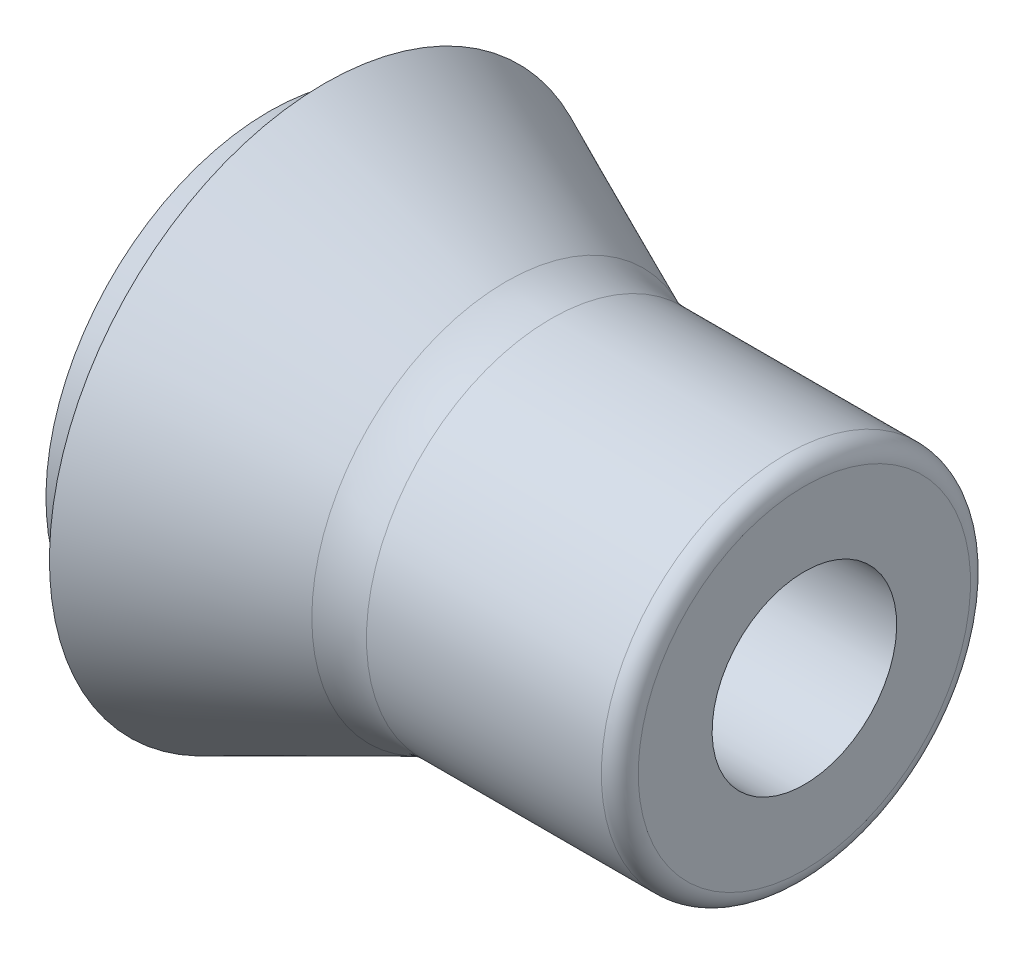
ISO-10303-21;
HEADER;
FILE_DESCRIPTION(('STEP AP214'),'2;1');
FILE_NAME('part.step','',(''),(''),'','','');
FILE_SCHEMA(('AUTOMOTIVE_DESIGN { 1 0 10303 214 1 1 1 1 }'));
ENDSEC;
DATA;
#1=APPLICATION_CONTEXT('core data for automotive mechanical design processes');
#2=APPLICATION_PROTOCOL_DEFINITION('international standard','automotive_design',2000,#1);
#3=PRODUCT_CONTEXT('',#1,'mechanical');
#4=PRODUCT('Part','Part','',(#3));
#5=PRODUCT_RELATED_PRODUCT_CATEGORY('part','',(#4));
#6=PRODUCT_DEFINITION_FORMATION('','',#4);
#7=PRODUCT_DEFINITION_CONTEXT('part definition',#1,'design');
#8=PRODUCT_DEFINITION('design','',#6,#7);
#9=PRODUCT_DEFINITION_SHAPE('','',#8);
#10=(LENGTH_UNIT() NAMED_UNIT(*) SI_UNIT(.MILLI.,.METRE.));
#11=(NAMED_UNIT(*) PLANE_ANGLE_UNIT() SI_UNIT($,.RADIAN.));
#12=(NAMED_UNIT(*) SI_UNIT($,.STERADIAN.) SOLID_ANGLE_UNIT());
#13=UNCERTAINTY_MEASURE_WITH_UNIT(LENGTH_MEASURE(1.E-05),#10,'distance_accuracy_value','');
#14=(GEOMETRIC_REPRESENTATION_CONTEXT(3) GLOBAL_UNCERTAINTY_ASSIGNED_CONTEXT((#13)) GLOBAL_UNIT_ASSIGNED_CONTEXT((#10,
#11,#12)) REPRESENTATION_CONTEXT('',''));
#15=CARTESIAN_POINT('',(0.,0.,0.));
#16=DIRECTION('',(0.,0.,1.));
#17=DIRECTION('',(1.,0.,0.));
#18=AXIS2_PLACEMENT_3D('',#15,#16,#17);
#19=CARTESIAN_POINT('',(0.,0.,0.));
#20=DIRECTION('',(1.,0.,0.));
#21=DIRECTION('',(0.,1.,0.));
#22=AXIS2_PLACEMENT_3D('',#19,#20,#21);
#23=CYLINDRICAL_SURFACE('',#22,5.);
#24=CARTESIAN_POINT('',(0.,0.,0.));
#25=DIRECTION('',(1.,0.,0.));
#26=DIRECTION('',(0.,1.,0.));
#27=AXIS2_PLACEMENT_3D('',#24,#25,#26);
#28=CIRCLE('',#27,5.);
#29=CARTESIAN_POINT('',(0.,5.,0.));
#30=VERTEX_POINT('',#29);
#31=EDGE_CURVE('E385',#30,#30,#28,.T.);
#32=ORIENTED_EDGE('',*,*,#31,.T.);
#33=EDGE_LOOP('',(#32));
#34=FACE_BOUND('',#33,.T.);
#35=CARTESIAN_POINT('',(-22.,0.,0.));
#36=DIRECTION('',(1.,0.,0.));
#37=DIRECTION('',(0.,1.,0.));
#38=AXIS2_PLACEMENT_3D('',#35,#36,#37);
#39=CIRCLE('',#38,5.);
#40=CARTESIAN_POINT('',(-22.,5.,0.));
#41=VERTEX_POINT('',#40);
#42=EDGE_CURVE('E10',#41,#41,#39,.T.);
#43=ORIENTED_EDGE('',*,*,#42,.F.);
#44=EDGE_LOOP('',(#43));
#45=FACE_BOUND('',#44,.T.);
#46=ADVANCED_FACE('F348',(#34,#45),#23,.F.);
#47=CARTESIAN_POINT('',(-22.,5.,0.));
#48=DIRECTION('',(-1.,0.,0.));
#49=DIRECTION('',(0.,-1.,0.));
#50=AXIS2_PLACEMENT_3D('',#47,#48,#49);
#51=PLANE('',#50);
#52=ORIENTED_EDGE('',*,*,#42,.T.);
#53=EDGE_LOOP('',(#52));
#54=FACE_BOUND('',#53,.T.);
#55=CARTESIAN_POINT('',(-22.,0.,0.));
#56=DIRECTION('',(1.,0.,0.));
#57=DIRECTION('',(0.,1.,0.));
#58=AXIS2_PLACEMENT_3D('',#55,#56,#57);
#59=CIRCLE('',#58,9.);
#60=CARTESIAN_POINT('',(-22.,9.,0.));
#61=VERTEX_POINT('',#60);
#62=EDGE_CURVE('E354',#61,#61,#59,.T.);
#63=ORIENTED_EDGE('',*,*,#62,.F.);
#64=EDGE_LOOP('',(#63));
#65=FACE_BOUND('',#64,.T.);
#66=ADVANCED_FACE('F403',(#54,#65),#51,.T.);
#67=CARTESIAN_POINT('',(0.,0.,0.));
#68=DIRECTION('',(1.,0.,0.));
#69=DIRECTION('',(0.,1.,0.));
#70=AXIS2_PLACEMENT_3D('',#67,#68,#69);
#71=CYLINDRICAL_SURFACE('',#70,9.);
#72=ORIENTED_EDGE('',*,*,#62,.T.);
#73=EDGE_LOOP('',(#72));
#74=FACE_BOUND('',#73,.T.);
#75=CARTESIAN_POINT('',(-29.,0.,0.));
#76=DIRECTION('',(1.,0.,0.));
#77=DIRECTION('',(0.,1.,0.));
#78=AXIS2_PLACEMENT_3D('',#75,#76,#77);
#79=CIRCLE('',#78,9.);
#80=CARTESIAN_POINT('',(-29.,8.99999999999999,0.));
#81=VERTEX_POINT('',#80);
#82=EDGE_CURVE('E358',#81,#81,#79,.T.);
#83=ORIENTED_EDGE('',*,*,#82,.F.);
#84=EDGE_LOOP('',(#83));
#85=FACE_BOUND('',#84,.T.);
#86=ADVANCED_FACE('F407',(#74,#85),#71,.F.);
#87=CARTESIAN_POINT('',(-29.,12.0856860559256,0.));
#88=DIRECTION('',(-1.,0.,0.));
#89=DIRECTION('',(0.,-1.,0.));
#90=AXIS2_PLACEMENT_3D('',#87,#88,#89);
#91=PLANE('',#90);
#92=ORIENTED_EDGE('',*,*,#82,.T.);
#93=EDGE_LOOP('',(#92));
#94=FACE_BOUND('',#93,.T.);
#95=CARTESIAN_POINT('',(-29.,0.,0.));
#96=DIRECTION('',(1.,0.,0.));
#97=DIRECTION('',(0.,1.,0.));
#98=AXIS2_PLACEMENT_3D('',#95,#96,#97);
#99=CIRCLE('',#98,12.0856860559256);
#100=CARTESIAN_POINT('',(-29.,12.0856860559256,0.));
#101=VERTEX_POINT('',#100);
#102=EDGE_CURVE('E362',#101,#101,#99,.T.);
#103=ORIENTED_EDGE('',*,*,#102,.F.);
#104=EDGE_LOOP('',(#103));
#105=FACE_BOUND('',#104,.T.);
#106=ADVANCED_FACE('F411',(#94,#105),#91,.T.);
#107=CARTESIAN_POINT('',(-26.,0.,0.));
#108=DIRECTION('',(-1.,0.,0.));
#109=DIRECTION('',(0.,-1.,0.));
#110=AXIS2_PLACEMENT_3D('',#107,#108,#109);
#111=CONICAL_SURFACE('',#110,10.75,0.41887902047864);
#112=ORIENTED_EDGE('',*,*,#102,.T.);
#113=EDGE_LOOP('',(#112));
#114=FACE_BOUND('',#113,.T.);
#115=CARTESIAN_POINT('',(-26.,0.,0.));
#116=DIRECTION('',(1.,0.,0.));
#117=DIRECTION('',(0.,1.,0.));
#118=AXIS2_PLACEMENT_3D('',#115,#116,#117);
#119=CIRCLE('',#118,10.75);
#120=CARTESIAN_POINT('',(-26.,10.75,0.));
#121=VERTEX_POINT('',#120);
#122=EDGE_CURVE('E367',#121,#121,#119,.T.);
#123=ORIENTED_EDGE('',*,*,#122,.F.);
#124=EDGE_LOOP('',(#123));
#125=FACE_BOUND('',#124,.T.);
#126=ADVANCED_FACE('F417',(#114,#125),#111,.T.);
#127=CARTESIAN_POINT('',(-26.,14.8975155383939,0.));
#128=DIRECTION('',(-1.,0.,0.));
#129=DIRECTION('',(0.,-1.,0.));
#130=AXIS2_PLACEMENT_3D('',#127,#128,#129);
#131=PLANE('',#130);
#132=ORIENTED_EDGE('',*,*,#122,.T.);
#133=EDGE_LOOP('',(#132));
#134=FACE_BOUND('',#133,.T.);
#135=CARTESIAN_POINT('',(-26.,0.,0.));
#136=DIRECTION('',(1.,0.,0.));
#137=DIRECTION('',(0.,1.,0.));
#138=AXIS2_PLACEMENT_3D('',#135,#136,#137);
#139=CIRCLE('',#138,14.8975155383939);
#140=CARTESIAN_POINT('',(-26.,14.8975155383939,0.));
#141=VERTEX_POINT('',#140);
#142=EDGE_CURVE('E370',#141,#141,#139,.T.);
#143=ORIENTED_EDGE('',*,*,#142,.F.);
#144=EDGE_LOOP('',(#143));
#145=FACE_BOUND('',#144,.T.);
#146=ADVANCED_FACE('F421',(#134,#145),#131,.T.);
#147=CARTESIAN_POINT('',(-16.1650804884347,0.,0.));
#148=DIRECTION('',(-1.,0.,0.));
#149=DIRECTION('',(0.,-1.,0.));
#150=AXIS2_PLACEMENT_3D('',#147,#148,#149);
#151=CONICAL_SURFACE('',#150,10.5187272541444,0.41887902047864);
#152=ORIENTED_EDGE('',*,*,#142,.T.);
#153=EDGE_LOOP('',(#152));
#154=FACE_BOUND('',#153,.T.);
#155=CARTESIAN_POINT('',(-16.1650804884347,0.,0.));
#156=DIRECTION('',(1.,0.,0.));
#157=DIRECTION('',(0.,1.,0.));
#158=AXIS2_PLACEMENT_3D('',#155,#156,#157);
#159=CIRCLE('',#158,10.5187272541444);
#160=CARTESIAN_POINT('',(-16.1650804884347,10.5187272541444,0.));
#161=VERTEX_POINT('',#160);
#162=EDGE_CURVE('E373',#161,#161,#159,.T.);
#163=ORIENTED_EDGE('',*,*,#162,.F.);
#164=EDGE_LOOP('',(#163));
#165=FACE_BOUND('',#164,.T.);
#166=ADVANCED_FACE('F425',(#154,#165),#151,.T.);
#167=CARTESIAN_POINT('',(-13.7246606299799,0.,0.));
#168=DIRECTION('',(1.,0.,0.));
#169=DIRECTION('',(0.,1.,0.));
#170=AXIS2_PLACEMENT_3D('',#167,#168,#169);
#171=TOROIDAL_SURFACE('',#170,16.,6.);
#172=ORIENTED_EDGE('',*,*,#162,.T.);
#173=EDGE_LOOP('',(#172));
#174=FACE_BOUND('',#173,.T.);
#175=CARTESIAN_POINT('',(-13.7246606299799,0.,0.));
#176=DIRECTION('',(1.,0.,0.));
#177=DIRECTION('',(0.,1.,0.));
#178=AXIS2_PLACEMENT_3D('',#175,#176,#177);
#179=CIRCLE('',#178,10.);
#180=CARTESIAN_POINT('',(-13.7246606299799,10.,0.));
#181=VERTEX_POINT('',#180);
#182=EDGE_CURVE('E376',#181,#181,#179,.T.);
#183=ORIENTED_EDGE('',*,*,#182,.F.);
#184=EDGE_LOOP('',(#183));
#185=FACE_BOUND('',#184,.T.);
#186=ADVANCED_FACE('F429',(#174,#185),#171,.F.);
#187=CARTESIAN_POINT('',(0.,0.,0.));
#188=DIRECTION('',(1.,0.,0.));
#189=DIRECTION('',(0.,1.,0.));
#190=AXIS2_PLACEMENT_3D('',#187,#188,#189);
#191=CYLINDRICAL_SURFACE('',#190,10.);
#192=ORIENTED_EDGE('',*,*,#182,.T.);
#193=EDGE_LOOP('',(#192));
#194=FACE_BOUND('',#193,.T.);
#195=CARTESIAN_POINT('',(-0.999999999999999,0.,0.));
#196=DIRECTION('',(1.,0.,0.));
#197=DIRECTION('',(0.,1.,0.));
#198=AXIS2_PLACEMENT_3D('',#195,#196,#197);
#199=CIRCLE('',#198,10.);
#200=CARTESIAN_POINT('',(-1.,10.,0.));
#201=VERTEX_POINT('',#200);
#202=EDGE_CURVE('E379',#201,#201,#199,.T.);
#203=ORIENTED_EDGE('',*,*,#202,.F.);
#204=EDGE_LOOP('',(#203));
#205=FACE_BOUND('',#204,.T.);
#206=ADVANCED_FACE('F399',(#194,#205),#191,.T.);
#207=CARTESIAN_POINT('',(-0.999999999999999,0.,0.));
#208=DIRECTION('',(1.,0.,0.));
#209=DIRECTION('',(0.,1.,0.));
#210=AXIS2_PLACEMENT_3D('',#207,#208,#209);
#211=TOROIDAL_SURFACE('',#210,9.,1.);
#212=ORIENTED_EDGE('',*,*,#202,.T.);
#213=EDGE_LOOP('',(#212));
#214=FACE_BOUND('',#213,.T.);
#215=CARTESIAN_POINT('',(0.,0.,0.));
#216=DIRECTION('',(1.,0.,0.));
#217=DIRECTION('',(0.,1.,0.));
#218=AXIS2_PLACEMENT_3D('',#215,#216,#217);
#219=CIRCLE('',#218,9.);
#220=CARTESIAN_POINT('',(0.,9.,0.));
#221=VERTEX_POINT('',#220);
#222=EDGE_CURVE('E382',#221,#221,#219,.T.);
#223=ORIENTED_EDGE('',*,*,#222,.F.);
#224=EDGE_LOOP('',(#223));
#225=FACE_BOUND('',#224,.T.);
#226=ADVANCED_FACE('F393',(#214,#225),#211,.T.);
#227=CARTESIAN_POINT('',(0.,9.,0.));
#228=DIRECTION('',(1.,0.,0.));
#229=DIRECTION('',(0.,1.,0.));
#230=AXIS2_PLACEMENT_3D('',#227,#228,#229);
#231=PLANE('',#230);
#232=ORIENTED_EDGE('',*,*,#222,.T.);
#233=EDGE_LOOP('',(#232));
#234=FACE_BOUND('',#233,.T.);
#235=ORIENTED_EDGE('',*,*,#31,.F.);
#236=EDGE_LOOP('',(#235));
#237=FACE_BOUND('',#236,.T.);
#238=ADVANCED_FACE('F391',(#234,#237),#231,.T.);
#239=CLOSED_SHELL('',(#46,#66,#86,#106,#126,#146,#166,#186,#206,#226,#238));
#240=MANIFOLD_SOLID_BREP('B2',#239);
#241=ADVANCED_BREP_SHAPE_REPRESENTATION('',(#18,#240),#14);
#242=SHAPE_DEFINITION_REPRESENTATION(#9,#241);
ENDSEC;
END-ISO-10303-21;
